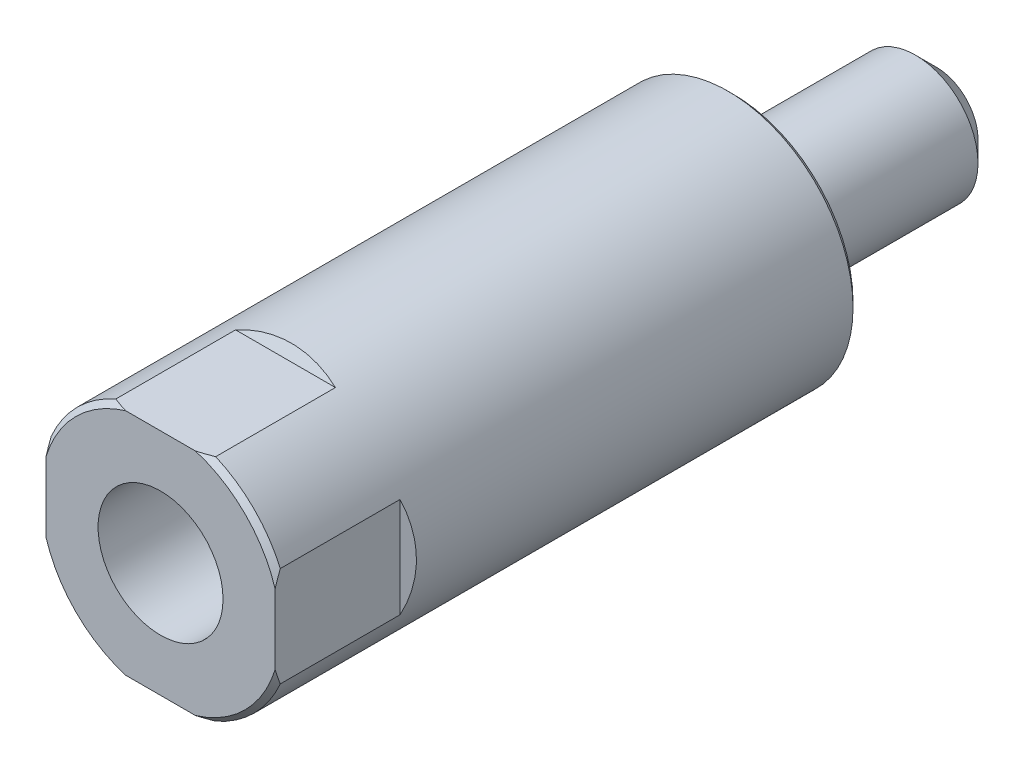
ISO-10303-21;
HEADER;
FILE_DESCRIPTION(('STEP AP214'),'2;1');
FILE_NAME('part.step','',(''),(''),'','','');
FILE_SCHEMA(('AUTOMOTIVE_DESIGN { 1 0 10303 214 1 1 1 1 }'));
ENDSEC;
DATA;
#1=APPLICATION_CONTEXT('core data for automotive mechanical design processes');
#2=APPLICATION_PROTOCOL_DEFINITION('international standard','automotive_design',2000,#1);
#3=PRODUCT_CONTEXT('',#1,'mechanical');
#4=PRODUCT('Part','Part','',(#3));
#5=PRODUCT_RELATED_PRODUCT_CATEGORY('part','',(#4));
#6=PRODUCT_DEFINITION_FORMATION('','',#4);
#7=PRODUCT_DEFINITION_CONTEXT('part definition',#1,'design');
#8=PRODUCT_DEFINITION('design','',#6,#7);
#9=PRODUCT_DEFINITION_SHAPE('','',#8);
#10=(LENGTH_UNIT() NAMED_UNIT(*) SI_UNIT(.MILLI.,.METRE.));
#11=(NAMED_UNIT(*) PLANE_ANGLE_UNIT() SI_UNIT($,.RADIAN.));
#12=(NAMED_UNIT(*) SI_UNIT($,.STERADIAN.) SOLID_ANGLE_UNIT());
#13=UNCERTAINTY_MEASURE_WITH_UNIT(LENGTH_MEASURE(1.E-05),#10,'distance_accuracy_value','');
#14=(GEOMETRIC_REPRESENTATION_CONTEXT(3) GLOBAL_UNCERTAINTY_ASSIGNED_CONTEXT((#13)) GLOBAL_UNIT_ASSIGNED_CONTEXT((#10,
#11,#12)) REPRESENTATION_CONTEXT('',''));
#15=CARTESIAN_POINT('',(0.,0.,0.));
#16=DIRECTION('',(0.,0.,1.));
#17=DIRECTION('',(1.,0.,0.));
#18=AXIS2_PLACEMENT_3D('',#15,#16,#17);
#19=CARTESIAN_POINT('',(0.,0.,-19.5));
#20=DIRECTION('',(0.,0.,1.));
#21=DIRECTION('',(1.,0.,0.));
#22=AXIS2_PLACEMENT_3D('',#19,#20,#21);
#23=PLANE('',#22);
#24=CARTESIAN_POINT('',(0.,0.,-19.5));
#25=DIRECTION('',(0.,0.,1.));
#26=DIRECTION('',(1.,0.,0.));
#27=AXIS2_PLACEMENT_3D('',#24,#25,#26);
#28=CIRCLE('',#27,4.);
#29=CARTESIAN_POINT('',(4.,0.,-19.5));
#30=VERTEX_POINT('',#29);
#31=EDGE_CURVE('E139',#30,#30,#28,.F.);
#32=ORIENTED_EDGE('',*,*,#31,.T.);
#33=EDGE_LOOP('',(#32));
#34=FACE_BOUND('',#33,.T.);
#35=ADVANCED_FACE('F14',(#34),#23,.F.);
#36=CARTESIAN_POINT('',(0.,0.,0.5));
#37=DIRECTION('',(0.,0.,1.));
#38=DIRECTION('',(1.,0.,0.));
#39=AXIS2_PLACEMENT_3D('',#36,#37,#38);
#40=CYLINDRICAL_SURFACE('',#39,6.);
#41=CARTESIAN_POINT('',(0.,0.,-17.5));
#42=DIRECTION('',(0.,0.,1.));
#43=DIRECTION('',(1.,0.,0.));
#44=AXIS2_PLACEMENT_3D('',#41,#42,#43);
#45=CIRCLE('',#44,6.);
#46=CARTESIAN_POINT('',(6.,0.,-17.5));
#47=VERTEX_POINT('',#46);
#48=EDGE_CURVE('E175',#47,#47,#45,.T.);
#49=ORIENTED_EDGE('',*,*,#48,.T.);
#50=EDGE_LOOP('',(#49));
#51=FACE_BOUND('',#50,.T.);
#52=CARTESIAN_POINT('',(0.,1.32706345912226E-13,0.));
#53=DIRECTION('',(0.,0.,1.));
#54=DIRECTION('',(1.,0.,0.));
#55=AXIS2_PLACEMENT_3D('',#52,#53,#54);
#56=CIRCLE('',#55,6.);
#57=CARTESIAN_POINT('',(6.,1.32706345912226E-13,0.));
#58=VERTEX_POINT('',#57);
#59=EDGE_CURVE('E136',#58,#58,#56,.T.);
#60=ORIENTED_EDGE('',*,*,#59,.F.);
#61=EDGE_LOOP('',(#60));
#62=FACE_BOUND('',#61,.T.);
#63=ADVANCED_FACE('F426',(#51,#62),#40,.T.);
#64=CARTESIAN_POINT('',(6.,0.,10.5));
#65=DIRECTION('',(0.,0.,-1.));
#66=DIRECTION('',(-1.,0.,0.));
#67=AXIS2_PLACEMENT_3D('',#64,#65,#66);
#68=PLANE('',#67);
#69=CARTESIAN_POINT('',(0.,0.,10.5));
#70=DIRECTION('',(0.,0.,1.));
#71=DIRECTION('',(1.,0.,0.));
#72=AXIS2_PLACEMENT_3D('',#69,#70,#71);
#73=CIRCLE('',#72,6.);
#74=CARTESIAN_POINT('',(6.,0.,10.5));
#75=VERTEX_POINT('',#74);
#76=EDGE_CURVE('E121',#75,#75,#73,.T.);
#77=ORIENTED_EDGE('',*,*,#76,.T.);
#78=EDGE_LOOP('',(#77));
#79=FACE_BOUND('',#78,.T.);
#80=ADVANCED_FACE('F353',(#79),#68,.F.);
#81=CARTESIAN_POINT('',(11.,-12.,43.));
#82=DIRECTION('',(-0.5,0.,-0.866025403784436));
#83=DIRECTION('',(-0.866025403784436,0.,0.5));
#84=AXIS2_PLACEMENT_3D('',#81,#82,#83);
#85=PLANE('',#84);
#86=CARTESIAN_POINT('',(0.,0.,49.350852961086));
#87=DIRECTION('',(-0.5,0.,-0.866025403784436));
#88=DIRECTION('',(0.866025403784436,0.,-0.5));
#89=AXIS2_PLACEMENT_3D('',#86,#87,#88);
#90=ELLIPSE('',#89,13.8564064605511,12.);
#91=CARTESIAN_POINT('',(11.,4.7958315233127,43.));
#92=VERTEX_POINT('',#91);
#93=CARTESIAN_POINT('',(11.,-4.79583152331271,43.));
#94=VERTEX_POINT('',#93);
#95=EDGE_CURVE('E158',#92,#94,#90,.T.);
#96=ORIENTED_EDGE('',*,*,#95,.F.);
#97=DIRECTION('',(0.,1.,0.));
#98=VECTOR('',#97,1.);
#99=CARTESIAN_POINT('',(11.,-12.,43.));
#100=LINE('',#99,#98);
#101=EDGE_CURVE('E149',#94,#92,#100,.T.);
#102=ORIENTED_EDGE('',*,*,#101,.F.);
#103=EDGE_LOOP('',(#96,#102));
#104=FACE_BOUND('',#103,.T.);
#105=ADVANCED_FACE('F223',(#104),#85,.F.);
#106=CARTESIAN_POINT('',(11.,-12.,55.));
#107=DIRECTION('',(-1.,0.,0.));
#108=DIRECTION('',(0.,0.,1.));
#109=AXIS2_PLACEMENT_3D('',#106,#107,#108);
#110=PLANE('',#109);
#111=DIRECTION('',(0.,-1.,0.));
#112=VECTOR('',#111,1.);
#113=CARTESIAN_POINT('',(11.,0.,55.));
#114=LINE('',#113,#112);
#115=CARTESIAN_POINT('',(11.,3.35410196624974,55.));
#116=VERTEX_POINT('',#115);
#117=CARTESIAN_POINT('',(11.,-3.35410196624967,55.));
#118=VERTEX_POINT('',#117);
#119=EDGE_CURVE('E156',#116,#118,#114,.T.);
#120=ORIENTED_EDGE('',*,*,#119,.T.);
#121=CARTESIAN_POINT('',(11.,-3.35410196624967,55.));
#122=CARTESIAN_POINT('',(11.,-3.47626806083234,54.9643692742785));
#123=CARTESIAN_POINT('',(11.,-3.59795060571,54.9270977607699));
#124=CARTESIAN_POINT('',(11.,-3.84025690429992,54.8494888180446));
#125=CARTESIAN_POINT('',(11.,-3.96088123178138,54.8091531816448));
#126=CARTESIAN_POINT('',(11.,-4.20111636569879,54.7255915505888));
#127=CARTESIAN_POINT('',(11.,-4.32072721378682,54.6823656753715));
#128=CARTESIAN_POINT('',(11.,-4.55900582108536,54.5931815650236));
#129=CARTESIAN_POINT('',(11.,-4.67767299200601,54.5472217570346));
#130=CARTESIAN_POINT('',(11.,-4.79583152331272,54.5));
#131=B_SPLINE_CURVE_WITH_KNOTS('',3,(#121,#122,#123,#124,#125,#126,#127,#128,#129,#130),
.UNSPECIFIED.,.F.,.F.,(4,2,2,2,4),(0.,0.381749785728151,0.763277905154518,1.14479026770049,
1.5265242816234),.UNSPECIFIED.);
#132=CARTESIAN_POINT('',(11.,-4.79583152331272,54.5));
#133=VERTEX_POINT('',#132);
#134=EDGE_CURVE('E22',#118,#133,#131,.T.);
#135=ORIENTED_EDGE('',*,*,#134,.T.);
#136=DIRECTION('',(0.,0.,-1.));
#137=VECTOR('',#136,1.);
#138=CARTESIAN_POINT('',(11.,-4.79583152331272,55.));
#139=LINE('',#138,#137);
#140=EDGE_CURVE('E152',#94,#133,#139,.F.);
#141=ORIENTED_EDGE('',*,*,#140,.F.);
#142=ORIENTED_EDGE('',*,*,#101,.T.);
#143=DIRECTION('',(0.,0.,-1.));
#144=VECTOR('',#143,1.);
#145=CARTESIAN_POINT('',(11.,4.79583152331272,55.));
#146=LINE('',#145,#144);
#147=CARTESIAN_POINT('',(11.,4.79583152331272,54.5));
#148=VERTEX_POINT('',#147);
#149=EDGE_CURVE('E154',#148,#92,#146,.T.);
#150=ORIENTED_EDGE('',*,*,#149,.F.);
#151=CARTESIAN_POINT('',(11.,4.79583152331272,54.5));
#152=CARTESIAN_POINT('',(11.,4.67767299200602,54.5472217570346));
#153=CARTESIAN_POINT('',(11.,4.55900582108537,54.5931815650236));
#154=CARTESIAN_POINT('',(11.,4.32072721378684,54.6823656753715));
#155=CARTESIAN_POINT('',(11.,4.20111636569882,54.7255915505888));
#156=CARTESIAN_POINT('',(11.,3.96088123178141,54.8091531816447));
#157=CARTESIAN_POINT('',(11.,3.84025690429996,54.8494888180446));
#158=CARTESIAN_POINT('',(11.,3.59795060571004,54.9270977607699));
#159=CARTESIAN_POINT('',(11.,3.47626806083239,54.9643692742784));
#160=CARTESIAN_POINT('',(11.,3.35410196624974,55.));
#161=B_SPLINE_CURVE_WITH_KNOTS('',3,(#151,#152,#153,#154,#155,#156,#157,#158,#159,#160),
.UNSPECIFIED.,.F.,.F.,(4,2,2,2,4),(0.,0.381734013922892,0.763246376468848,1.1447744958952,
1.52652428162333),.UNSPECIFIED.);
#162=EDGE_CURVE('E227',#148,#116,#161,.T.);
#163=ORIENTED_EDGE('',*,*,#162,.T.);
#164=EDGE_LOOP('',(#120,#135,#141,#142,#150,#163));
#165=FACE_BOUND('',#164,.T.);
#166=ADVANCED_FACE('F217',(#165),#110,.F.);
#167=CARTESIAN_POINT('',(12.,11.,43.));
#168=DIRECTION('',(0.,-0.5,-0.866025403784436));
#169=DIRECTION('',(0.,0.866025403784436,-0.5));
#170=AXIS2_PLACEMENT_3D('',#167,#168,#169);
#171=PLANE('',#170);
#172=CARTESIAN_POINT('',(0.,0.,49.350852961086));
#173=DIRECTION('',(0.,-0.5,-0.866025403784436));
#174=DIRECTION('',(0.,0.866025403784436,-0.5));
#175=AXIS2_PLACEMENT_3D('',#172,#173,#174);
#176=ELLIPSE('',#175,13.8564064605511,12.);
#177=CARTESIAN_POINT('',(-4.79583152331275,11.,43.));
#178=VERTEX_POINT('',#177);
#179=CARTESIAN_POINT('',(4.79583152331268,11.,43.));
#180=VERTEX_POINT('',#179);
#181=EDGE_CURVE('E168',#178,#180,#176,.T.);
#182=ORIENTED_EDGE('',*,*,#181,.F.);
#183=DIRECTION('',(-1.,0.,0.));
#184=VECTOR('',#183,1.);
#185=CARTESIAN_POINT('',(12.,11.,43.));
#186=LINE('',#185,#184);
#187=EDGE_CURVE('E114',#180,#178,#186,.T.);
#188=ORIENTED_EDGE('',*,*,#187,.F.);
#189=EDGE_LOOP('',(#182,#188));
#190=FACE_BOUND('',#189,.T.);
#191=ADVANCED_FACE('F222',(#190),#171,.F.);
#192=CARTESIAN_POINT('',(12.,11.,55.));
#193=DIRECTION('',(0.,-1.,0.));
#194=DIRECTION('',(1.,0.,0.));
#195=AXIS2_PLACEMENT_3D('',#192,#193,#194);
#196=PLANE('',#195);
#197=DIRECTION('',(0.,0.,-1.));
#198=VECTOR('',#197,1.);
#199=CARTESIAN_POINT('',(-4.79583152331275,11.,55.));
#200=LINE('',#199,#198);
#201=CARTESIAN_POINT('',(-4.79583152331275,11.,54.5));
#202=VERTEX_POINT('',#201);
#203=EDGE_CURVE('E133',#202,#178,#200,.T.);
#204=ORIENTED_EDGE('',*,*,#203,.F.);
#205=CARTESIAN_POINT('',(-4.79583152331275,11.,54.5));
#206=CARTESIAN_POINT('',(-4.67767299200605,11.,54.5472217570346));
#207=CARTESIAN_POINT('',(-4.55900582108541,10.9999999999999,54.5931815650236));
#208=CARTESIAN_POINT('',(-4.32072721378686,10.9999999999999,54.6823656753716));
#209=CARTESIAN_POINT('',(-4.20111636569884,10.9999999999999,54.7255915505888));
#210=CARTESIAN_POINT('',(-3.96088123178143,10.9999999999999,54.8091531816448));
#211=CARTESIAN_POINT('',(-3.84025690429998,10.9999999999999,54.8494888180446));
#212=CARTESIAN_POINT('',(-3.59795060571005,10.9999999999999,54.92709776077));
#213=CARTESIAN_POINT('',(-3.47626806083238,11.,54.9643692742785));
#214=CARTESIAN_POINT('',(-3.35410196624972,11.,55.));
#215=B_SPLINE_CURVE_WITH_KNOTS('',3,(#205,#206,#207,#208,#209,#210,#211,#212,#213,#214),
.UNSPECIFIED.,.F.,.F.,(4,2,2,2,4),(0.,0.381734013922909,0.763246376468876,1.14477449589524,
1.52652428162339),.UNSPECIFIED.);
#216=CARTESIAN_POINT('',(-3.3541019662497,11.,55.));
#217=VERTEX_POINT('',#216);
#218=EDGE_CURVE('E253',#202,#217,#215,.T.);
#219=ORIENTED_EDGE('',*,*,#218,.T.);
#220=DIRECTION('',(1.,0.,0.));
#221=VECTOR('',#220,1.);
#222=CARTESIAN_POINT('',(0.,11.,55.));
#223=LINE('',#222,#221);
#224=CARTESIAN_POINT('',(3.3541019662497,11.,55.));
#225=VERTEX_POINT('',#224);
#226=EDGE_CURVE('E165',#217,#225,#223,.T.);
#227=ORIENTED_EDGE('',*,*,#226,.T.);
#228=CARTESIAN_POINT('',(3.3541019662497,11.,55.));
#229=CARTESIAN_POINT('',(3.47626806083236,11.,54.9643692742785));
#230=CARTESIAN_POINT('',(3.59795060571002,11.,54.92709776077));
#231=CARTESIAN_POINT('',(3.84025690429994,11.,54.8494888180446));
#232=CARTESIAN_POINT('',(3.96088123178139,11.,54.8091531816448));
#233=CARTESIAN_POINT('',(4.2011163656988,11.,54.7255915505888));
#234=CARTESIAN_POINT('',(4.32072721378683,11.,54.6823656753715));
#235=CARTESIAN_POINT('',(4.55900582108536,11.,54.5931815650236));
#236=CARTESIAN_POINT('',(4.677672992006,11.,54.5472217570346));
#237=CARTESIAN_POINT('',(4.7958315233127,11.,54.5));
#238=B_SPLINE_CURVE_WITH_KNOTS('',3,(#228,#229,#230,#231,#232,#233,#234,#235,#236,#237),
.UNSPECIFIED.,.F.,.F.,(4,2,2,2,4),(0.,0.381749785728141,0.763277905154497,1.14479026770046,
1.52652428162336),.UNSPECIFIED.);
#239=CARTESIAN_POINT('',(4.79583152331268,11.,54.5));
#240=VERTEX_POINT('',#239);
#241=EDGE_CURVE('E274',#225,#240,#238,.T.);
#242=ORIENTED_EDGE('',*,*,#241,.T.);
#243=DIRECTION('',(0.,0.,-1.));
#244=VECTOR('',#243,1.);
#245=CARTESIAN_POINT('',(4.79583152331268,11.,55.));
#246=LINE('',#245,#244);
#247=EDGE_CURVE('E131',#180,#240,#246,.F.);
#248=ORIENTED_EDGE('',*,*,#247,.F.);
#249=ORIENTED_EDGE('',*,*,#187,.T.);
#250=EDGE_LOOP('',(#204,#219,#227,#242,#248,#249));
#251=FACE_BOUND('',#250,.T.);
#252=ADVANCED_FACE('F267',(#251),#196,.F.);
#253=CARTESIAN_POINT('',(-11.,-12.,43.));
#254=DIRECTION('',(0.5,0.,-0.866025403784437));
#255=DIRECTION('',(-0.866025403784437,0.,-0.5));
#256=AXIS2_PLACEMENT_3D('',#253,#254,#255);
#257=PLANE('',#256);
#258=CARTESIAN_POINT('',(0.,0.,49.3508529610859));
#259=DIRECTION('',(0.5,0.,-0.866025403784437));
#260=DIRECTION('',(-0.866025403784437,0.,-0.5));
#261=AXIS2_PLACEMENT_3D('',#258,#259,#260);
#262=ELLIPSE('',#261,13.856406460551,12.);
#263=CARTESIAN_POINT('',(-11.,-4.79583152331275,43.));
#264=VERTEX_POINT('',#263);
#265=CARTESIAN_POINT('',(-11.,4.79583152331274,43.));
#266=VERTEX_POINT('',#265);
#267=EDGE_CURVE('E163',#264,#266,#262,.T.);
#268=ORIENTED_EDGE('',*,*,#267,.F.);
#269=DIRECTION('',(0.,1.,0.));
#270=VECTOR('',#269,1.);
#271=CARTESIAN_POINT('',(-11.,-12.,43.));
#272=LINE('',#271,#270);
#273=EDGE_CURVE('E142',#264,#266,#272,.T.);
#274=ORIENTED_EDGE('',*,*,#273,.T.);
#275=EDGE_LOOP('',(#268,#274));
#276=FACE_BOUND('',#275,.T.);
#277=ADVANCED_FACE('F213',(#276),#257,.F.);
#278=CARTESIAN_POINT('',(-11.,-12.,55.));
#279=DIRECTION('',(1.,0.,0.));
#280=DIRECTION('',(0.,0.,-1.));
#281=AXIS2_PLACEMENT_3D('',#278,#279,#280);
#282=PLANE('',#281);
#283=DIRECTION('',(0.,1.,0.));
#284=VECTOR('',#283,1.);
#285=CARTESIAN_POINT('',(-11.,0.,55.));
#286=LINE('',#285,#284);
#287=CARTESIAN_POINT('',(-11.,-3.35410196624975,55.));
#288=VERTEX_POINT('',#287);
#289=CARTESIAN_POINT('',(-11.,3.35410196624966,55.));
#290=VERTEX_POINT('',#289);
#291=EDGE_CURVE('E160',#288,#290,#286,.T.);
#292=ORIENTED_EDGE('',*,*,#291,.T.);
#293=CARTESIAN_POINT('',(-11.,3.35410196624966,55.));
#294=CARTESIAN_POINT('',(-11.,3.47626806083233,54.9643692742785));
#295=CARTESIAN_POINT('',(-11.,3.59795060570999,54.9270977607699));
#296=CARTESIAN_POINT('',(-11.,3.84025690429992,54.8494888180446));
#297=CARTESIAN_POINT('',(-11.,3.96088123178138,54.8091531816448));
#298=CARTESIAN_POINT('',(-11.,4.2011163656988,54.7255915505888));
#299=CARTESIAN_POINT('',(-11.,4.32072721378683,54.6823656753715));
#300=CARTESIAN_POINT('',(-11.,4.55900582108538,54.5931815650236));
#301=CARTESIAN_POINT('',(-11.,4.67767299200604,54.5472217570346));
#302=CARTESIAN_POINT('',(-11.,4.79583152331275,54.5));
#303=B_SPLINE_CURVE_WITH_KNOTS('',3,(#293,#294,#295,#296,#297,#298,#299,#300,#301,#302),
.UNSPECIFIED.,.F.,.F.,(4,2,2,2,4),(0.,0.381749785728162,0.763277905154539,1.14479026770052,
1.52652428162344),.UNSPECIFIED.);
#304=CARTESIAN_POINT('',(-11.,4.79583152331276,54.5));
#305=VERTEX_POINT('',#304);
#306=EDGE_CURVE('E198',#290,#305,#303,.T.);
#307=ORIENTED_EDGE('',*,*,#306,.T.);
#308=DIRECTION('',(0.,0.,-1.));
#309=VECTOR('',#308,1.);
#310=CARTESIAN_POINT('',(-11.,4.79583152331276,55.));
#311=LINE('',#310,#309);
#312=EDGE_CURVE('E145',#266,#305,#311,.F.);
#313=ORIENTED_EDGE('',*,*,#312,.F.);
#314=ORIENTED_EDGE('',*,*,#273,.F.);
#315=DIRECTION('',(0.,0.,-1.));
#316=VECTOR('',#315,1.);
#317=CARTESIAN_POINT('',(-11.,-4.79583152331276,55.));
#318=LINE('',#317,#316);
#319=CARTESIAN_POINT('',(-11.,-4.79583152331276,54.5));
#320=VERTEX_POINT('',#319);
#321=EDGE_CURVE('E147',#320,#264,#318,.T.);
#322=ORIENTED_EDGE('',*,*,#321,.F.);
#323=CARTESIAN_POINT('',(-11.,-4.79583152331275,54.5));
#324=CARTESIAN_POINT('',(-11.,-4.67767299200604,54.5472217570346));
#325=CARTESIAN_POINT('',(-11.,-4.5590058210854,54.5931815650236));
#326=CARTESIAN_POINT('',(-11.,-4.32072721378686,54.6823656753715));
#327=CARTESIAN_POINT('',(-11.,-4.20111636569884,54.7255915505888));
#328=CARTESIAN_POINT('',(-11.,-3.96088123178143,54.8091531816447));
#329=CARTESIAN_POINT('',(-11.,-3.84025690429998,54.8494888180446));
#330=CARTESIAN_POINT('',(-11.,-3.59795060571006,54.9270977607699));
#331=CARTESIAN_POINT('',(-11.,-3.4762680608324,54.9643692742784));
#332=CARTESIAN_POINT('',(-11.,-3.35410196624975,55.));
#333=B_SPLINE_CURVE_WITH_KNOTS('',3,(#323,#324,#325,#326,#327,#328,#329,#330,#331,#332),
.UNSPECIFIED.,.F.,.F.,(4,2,2,2,4),(0.,0.381734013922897,0.763246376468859,1.14477449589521,
1.52652428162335),.UNSPECIFIED.);
#334=EDGE_CURVE('E190',#320,#288,#333,.T.);
#335=ORIENTED_EDGE('',*,*,#334,.T.);
#336=EDGE_LOOP('',(#292,#307,#313,#314,#322,#335));
#337=FACE_BOUND('',#336,.T.);
#338=ADVANCED_FACE('F208',(#337),#282,.F.);
#339=CARTESIAN_POINT('',(12.,-11.,43.));
#340=DIRECTION('',(0.,0.5,-0.866025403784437));
#341=DIRECTION('',(0.,0.866025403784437,0.5));
#342=AXIS2_PLACEMENT_3D('',#339,#340,#341);
#343=PLANE('',#342);
#344=CARTESIAN_POINT('',(0.,0.,49.3508529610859));
#345=DIRECTION('',(0.,0.5,-0.866025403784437));
#346=DIRECTION('',(0.,-0.866025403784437,-0.5));
#347=AXIS2_PLACEMENT_3D('',#344,#345,#346);
#348=ELLIPSE('',#347,13.856406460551,12.);
#349=CARTESIAN_POINT('',(4.79583152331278,-11.,43.));
#350=VERTEX_POINT('',#349);
#351=CARTESIAN_POINT('',(-4.79583152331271,-11.,43.));
#352=VERTEX_POINT('',#351);
#353=EDGE_CURVE('E107',#350,#352,#348,.T.);
#354=ORIENTED_EDGE('',*,*,#353,.F.);
#355=DIRECTION('',(-1.,0.,0.));
#356=VECTOR('',#355,1.);
#357=CARTESIAN_POINT('',(12.,-11.,43.));
#358=LINE('',#357,#356);
#359=EDGE_CURVE('E120',#350,#352,#358,.T.);
#360=ORIENTED_EDGE('',*,*,#359,.T.);
#361=EDGE_LOOP('',(#354,#360));
#362=FACE_BOUND('',#361,.T.);
#363=ADVANCED_FACE('F119',(#362),#343,.F.);
#364=CARTESIAN_POINT('',(12.,-11.,55.));
#365=DIRECTION('',(0.,1.,0.));
#366=DIRECTION('',(-1.,0.,0.));
#367=AXIS2_PLACEMENT_3D('',#364,#365,#366);
#368=PLANE('',#367);
#369=DIRECTION('',(-1.,0.,0.));
#370=VECTOR('',#369,1.);
#371=CARTESIAN_POINT('',(0.,-11.,55.));
#372=LINE('',#371,#370);
#373=CARTESIAN_POINT('',(3.35410196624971,-11.,55.));
#374=VERTEX_POINT('',#373);
#375=CARTESIAN_POINT('',(-3.35410196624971,-11.,55.));
#376=VERTEX_POINT('',#375);
#377=EDGE_CURVE('E122',#374,#376,#372,.T.);
#378=ORIENTED_EDGE('',*,*,#377,.T.);
#379=CARTESIAN_POINT('',(-3.35410196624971,-11.,55.));
#380=CARTESIAN_POINT('',(-3.47626806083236,-11.,54.9643692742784));
#381=CARTESIAN_POINT('',(-3.59795060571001,-11.,54.9270977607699));
#382=CARTESIAN_POINT('',(-3.84025690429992,-11.0000000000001,54.8494888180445));
#383=CARTESIAN_POINT('',(-3.96088123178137,-11.0000000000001,54.8091531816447));
#384=CARTESIAN_POINT('',(-4.20111636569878,-11.0000000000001,54.7255915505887));
#385=CARTESIAN_POINT('',(-4.3207272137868,-11.0000000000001,54.6823656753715));
#386=CARTESIAN_POINT('',(-4.55900582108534,-11.0000000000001,54.5931815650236));
#387=CARTESIAN_POINT('',(-4.67767299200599,-11.,54.5472217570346));
#388=CARTESIAN_POINT('',(-4.7958315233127,-11.,54.5));
#389=B_SPLINE_CURVE_WITH_KNOTS('',3,(#379,#380,#381,#382,#383,#384,#385,#386,#387,#388),
.UNSPECIFIED.,.F.,.F.,(4,2,2,2,4),(0.,0.381749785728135,0.76327790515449,1.14479026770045,
1.52652428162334),.UNSPECIFIED.);
#390=CARTESIAN_POINT('',(-4.79583152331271,-11.,54.5));
#391=VERTEX_POINT('',#390);
#392=EDGE_CURVE('E252',#376,#391,#389,.T.);
#393=ORIENTED_EDGE('',*,*,#392,.T.);
#394=DIRECTION('',(0.,0.,-1.));
#395=VECTOR('',#394,1.);
#396=CARTESIAN_POINT('',(-4.79583152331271,-11.,55.));
#397=LINE('',#396,#395);
#398=EDGE_CURVE('E115',#352,#391,#397,.F.);
#399=ORIENTED_EDGE('',*,*,#398,.F.);
#400=ORIENTED_EDGE('',*,*,#359,.F.);
#401=DIRECTION('',(0.,0.,-1.));
#402=VECTOR('',#401,1.);
#403=CARTESIAN_POINT('',(4.79583152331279,-11.,55.));
#404=LINE('',#403,#402);
#405=CARTESIAN_POINT('',(4.79583152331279,-11.,54.5));
#406=VERTEX_POINT('',#405);
#407=EDGE_CURVE('E102',#406,#350,#404,.T.);
#408=ORIENTED_EDGE('',*,*,#407,.F.);
#409=CARTESIAN_POINT('',(4.79583152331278,-11.,54.5));
#410=CARTESIAN_POINT('',(4.67767299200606,-11.,54.5472217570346));
#411=CARTESIAN_POINT('',(4.5590058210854,-11.,54.5931815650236));
#412=CARTESIAN_POINT('',(4.32072721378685,-11.,54.6823656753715));
#413=CARTESIAN_POINT('',(4.20111636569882,-11.,54.7255915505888));
#414=CARTESIAN_POINT('',(3.9608812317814,-11.,54.8091531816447));
#415=CARTESIAN_POINT('',(3.84025690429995,-11.,54.8494888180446));
#416=CARTESIAN_POINT('',(3.59795060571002,-11.,54.9270977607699));
#417=CARTESIAN_POINT('',(3.47626806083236,-11.,54.9643692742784));
#418=CARTESIAN_POINT('',(3.3541019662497,-11.,55.));
#419=B_SPLINE_CURVE_WITH_KNOTS('',3,(#409,#410,#411,#412,#413,#414,#415,#416,#417,#418),
.UNSPECIFIED.,.F.,.F.,(4,2,2,2,4),(0.,0.381734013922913,0.763246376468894,1.14477449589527,
1.52652428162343),.UNSPECIFIED.);
#420=EDGE_CURVE('E245',#406,#374,#419,.T.);
#421=ORIENTED_EDGE('',*,*,#420,.T.);
#422=EDGE_LOOP('',(#378,#393,#399,#400,#408,#421));
#423=FACE_BOUND('',#422,.T.);
#424=ADVANCED_FACE('F125',(#423),#368,.F.);
#425=CARTESIAN_POINT('',(0.,0.,55.));
#426=DIRECTION('',(0.,0.,-1.));
#427=DIRECTION('',(-1.,0.,0.));
#428=AXIS2_PLACEMENT_3D('',#425,#426,#427);
#429=CYLINDRICAL_SURFACE('',#428,12.);
#430=CARTESIAN_POINT('',(0.,0.,0.5));
#431=DIRECTION('',(0.,0.,1.));
#432=DIRECTION('',(1.,0.,0.));
#433=AXIS2_PLACEMENT_3D('',#430,#431,#432);
#434=CIRCLE('',#433,12.);
#435=CARTESIAN_POINT('',(12.,0.,0.5));
#436=VERTEX_POINT('',#435);
#437=EDGE_CURVE('E285',#436,#436,#434,.T.);
#438=ORIENTED_EDGE('',*,*,#437,.T.);
#439=EDGE_LOOP('',(#438));
#440=FACE_BOUND('',#439,.T.);
#441=ORIENTED_EDGE('',*,*,#312,.T.);
#442=CARTESIAN_POINT('',(0.,0.,54.5));
#443=DIRECTION('',(0.,0.,1.));
#444=DIRECTION('',(1.,0.,0.));
#445=AXIS2_PLACEMENT_3D('',#442,#443,#444);
#446=CIRCLE('',#445,12.);
#447=EDGE_CURVE('E280',#305,#202,#446,.F.);
#448=ORIENTED_EDGE('',*,*,#447,.T.);
#449=ORIENTED_EDGE('',*,*,#203,.T.);
#450=ORIENTED_EDGE('',*,*,#181,.T.);
#451=ORIENTED_EDGE('',*,*,#247,.T.);
#452=CARTESIAN_POINT('',(0.,0.,54.5));
#453=DIRECTION('',(0.,0.,1.));
#454=DIRECTION('',(1.,0.,0.));
#455=AXIS2_PLACEMENT_3D('',#452,#453,#454);
#456=CIRCLE('',#455,12.);
#457=EDGE_CURVE('E36',#240,#148,#456,.F.);
#458=ORIENTED_EDGE('',*,*,#457,.T.);
#459=ORIENTED_EDGE('',*,*,#149,.T.);
#460=ORIENTED_EDGE('',*,*,#95,.T.);
#461=ORIENTED_EDGE('',*,*,#140,.T.);
#462=CARTESIAN_POINT('',(0.,0.,54.5));
#463=DIRECTION('',(0.,0.,1.));
#464=DIRECTION('',(1.,0.,0.));
#465=AXIS2_PLACEMENT_3D('',#462,#463,#464);
#466=CIRCLE('',#465,12.);
#467=EDGE_CURVE('E110',#133,#406,#466,.F.);
#468=ORIENTED_EDGE('',*,*,#467,.T.);
#469=ORIENTED_EDGE('',*,*,#407,.T.);
#470=ORIENTED_EDGE('',*,*,#353,.T.);
#471=ORIENTED_EDGE('',*,*,#398,.T.);
#472=CARTESIAN_POINT('',(0.,0.,54.5));
#473=DIRECTION('',(0.,0.,1.));
#474=DIRECTION('',(1.,0.,0.));
#475=AXIS2_PLACEMENT_3D('',#472,#473,#474);
#476=CIRCLE('',#475,12.);
#477=EDGE_CURVE('E282',#391,#320,#476,.F.);
#478=ORIENTED_EDGE('',*,*,#477,.T.);
#479=ORIENTED_EDGE('',*,*,#321,.T.);
#480=ORIENTED_EDGE('',*,*,#267,.T.);
#481=EDGE_LOOP('',(#441,#448,#449,#450,#451,#458,#459,#460,#461,#468,#469,#470,#471,#478,#479,#480));
#482=FACE_BOUND('',#481,.T.);
#483=ADVANCED_FACE('F105',(#440,#482),#429,.T.);
#484=CARTESIAN_POINT('',(0.,0.,0.));
#485=DIRECTION('',(0.,0.,1.));
#486=DIRECTION('',(1.,0.,0.));
#487=AXIS2_PLACEMENT_3D('',#484,#485,#486);
#488=PLANE('',#487);
#489=CARTESIAN_POINT('',(0.,0.,0.));
#490=DIRECTION('',(0.,0.,1.));
#491=DIRECTION('',(1.,0.,0.));
#492=AXIS2_PLACEMENT_3D('',#489,#490,#491);
#493=CIRCLE('',#492,11.5);
#494=CARTESIAN_POINT('',(11.5,0.,0.));
#495=VERTEX_POINT('',#494);
#496=EDGE_CURVE('E9',#495,#495,#493,.F.);
#497=ORIENTED_EDGE('',*,*,#496,.T.);
#498=EDGE_LOOP('',(#497));
#499=FACE_BOUND('',#498,.T.);
#500=ORIENTED_EDGE('',*,*,#59,.T.);
#501=EDGE_LOOP('',(#500));
#502=FACE_BOUND('',#501,.T.);
#503=ADVANCED_FACE('F320',(#499,#502),#488,.F.);
#504=CARTESIAN_POINT('',(0.,0.,55.));
#505=DIRECTION('',(0.,0.,1.));
#506=DIRECTION('',(1.,0.,0.));
#507=AXIS2_PLACEMENT_3D('',#504,#505,#506);
#508=PLANE('',#507);
#509=ORIENTED_EDGE('',*,*,#226,.F.);
#510=CARTESIAN_POINT('',(0.,0.,55.));
#511=DIRECTION('',(0.,0.,1.));
#512=DIRECTION('',(1.,0.,0.));
#513=AXIS2_PLACEMENT_3D('',#510,#511,#512);
#514=CIRCLE('',#513,11.5);
#515=EDGE_CURVE('E187',#217,#290,#514,.T.);
#516=ORIENTED_EDGE('',*,*,#515,.T.);
#517=ORIENTED_EDGE('',*,*,#291,.F.);
#518=CARTESIAN_POINT('',(0.,0.,55.));
#519=DIRECTION('',(0.,0.,1.));
#520=DIRECTION('',(1.,0.,0.));
#521=AXIS2_PLACEMENT_3D('',#518,#519,#520);
#522=CIRCLE('',#521,11.5);
#523=EDGE_CURVE('E184',#288,#376,#522,.T.);
#524=ORIENTED_EDGE('',*,*,#523,.T.);
#525=ORIENTED_EDGE('',*,*,#377,.F.);
#526=CARTESIAN_POINT('',(0.,0.,55.));
#527=DIRECTION('',(0.,0.,1.));
#528=DIRECTION('',(1.,0.,0.));
#529=AXIS2_PLACEMENT_3D('',#526,#527,#528);
#530=CIRCLE('',#529,11.5);
#531=EDGE_CURVE('E181',#374,#118,#530,.T.);
#532=ORIENTED_EDGE('',*,*,#531,.T.);
#533=ORIENTED_EDGE('',*,*,#119,.F.);
#534=CARTESIAN_POINT('',(0.,0.,55.));
#535=DIRECTION('',(0.,0.,1.));
#536=DIRECTION('',(1.,0.,0.));
#537=AXIS2_PLACEMENT_3D('',#534,#535,#536);
#538=CIRCLE('',#537,11.5);
#539=EDGE_CURVE('E178',#116,#225,#538,.T.);
#540=ORIENTED_EDGE('',*,*,#539,.T.);
#541=EDGE_LOOP('',(#509,#516,#517,#524,#525,#532,#533,#540));
#542=FACE_BOUND('',#541,.T.);
#543=CARTESIAN_POINT('',(0.,1.32706345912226E-13,55.));
#544=DIRECTION('',(0.,0.,1.));
#545=DIRECTION('',(1.,0.,0.));
#546=AXIS2_PLACEMENT_3D('',#543,#544,#545);
#547=CIRCLE('',#546,6.);
#548=CARTESIAN_POINT('',(6.,1.32706345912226E-13,55.));
#549=VERTEX_POINT('',#548);
#550=EDGE_CURVE('E135',#549,#549,#547,.T.);
#551=ORIENTED_EDGE('',*,*,#550,.F.);
#552=EDGE_LOOP('',(#551));
#553=FACE_BOUND('',#552,.T.);
#554=ADVANCED_FACE('F301',(#542,#553),#508,.T.);
#555=CARTESIAN_POINT('',(0.,1.32706345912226E-13,55.));
#556=DIRECTION('',(0.,0.,1.));
#557=DIRECTION('',(1.,0.,0.));
#558=AXIS2_PLACEMENT_3D('',#555,#556,#557);
#559=CYLINDRICAL_SURFACE('',#558,6.);
#560=ORIENTED_EDGE('',*,*,#76,.F.);
#561=EDGE_LOOP('',(#560));
#562=FACE_BOUND('',#561,.T.);
#563=ORIENTED_EDGE('',*,*,#550,.T.);
#564=EDGE_LOOP('',(#563));
#565=FACE_BOUND('',#564,.T.);
#566=ADVANCED_FACE('F215',(#562,#565),#559,.F.);
#567=CARTESIAN_POINT('',(0.,0.,-19.5));
#568=DIRECTION('',(0.,0.,1.));
#569=DIRECTION('',(1.,0.,0.));
#570=AXIS2_PLACEMENT_3D('',#567,#568,#569);
#571=CONICAL_SURFACE('',#570,4.,0.785398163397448);
#572=ORIENTED_EDGE('',*,*,#48,.F.);
#573=EDGE_LOOP('',(#572));
#574=FACE_BOUND('',#573,.T.);
#575=ORIENTED_EDGE('',*,*,#31,.F.);
#576=EDGE_LOOP('',(#575));
#577=FACE_BOUND('',#576,.T.);
#578=ADVANCED_FACE('F317',(#574,#577),#571,.T.);
#579=CARTESIAN_POINT('',(0.,0.,55.));
#580=DIRECTION('',(0.,0.,-1.));
#581=DIRECTION('',(-1.,0.,0.));
#582=AXIS2_PLACEMENT_3D('',#579,#580,#581);
#583=CONICAL_SURFACE('',#582,11.5,0.785398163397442);
#584=ORIENTED_EDGE('',*,*,#218,.F.);
#585=ORIENTED_EDGE('',*,*,#447,.F.);
#586=ORIENTED_EDGE('',*,*,#306,.F.);
#587=ORIENTED_EDGE('',*,*,#515,.F.);
#588=EDGE_LOOP('',(#584,#585,#586,#587));
#589=FACE_BOUND('',#588,.T.);
#590=ADVANCED_FACE('F298',(#589),#583,.T.);
#591=CARTESIAN_POINT('',(0.,0.,55.));
#592=DIRECTION('',(0.,0.,-1.));
#593=DIRECTION('',(-1.,0.,0.));
#594=AXIS2_PLACEMENT_3D('',#591,#592,#593);
#595=CONICAL_SURFACE('',#594,11.5,0.785398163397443);
#596=ORIENTED_EDGE('',*,*,#334,.F.);
#597=ORIENTED_EDGE('',*,*,#477,.F.);
#598=ORIENTED_EDGE('',*,*,#392,.F.);
#599=ORIENTED_EDGE('',*,*,#523,.F.);
#600=EDGE_LOOP('',(#596,#597,#598,#599));
#601=FACE_BOUND('',#600,.T.);
#602=ADVANCED_FACE('F205',(#601),#595,.T.);
#603=CARTESIAN_POINT('',(0.,0.,55.));
#604=DIRECTION('',(0.,0.,-1.));
#605=DIRECTION('',(-1.,0.,0.));
#606=AXIS2_PLACEMENT_3D('',#603,#604,#605);
#607=CONICAL_SURFACE('',#606,11.5,0.785398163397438);
#608=ORIENTED_EDGE('',*,*,#420,.F.);
#609=ORIENTED_EDGE('',*,*,#467,.F.);
#610=ORIENTED_EDGE('',*,*,#134,.F.);
#611=ORIENTED_EDGE('',*,*,#531,.F.);
#612=EDGE_LOOP('',(#608,#609,#610,#611));
#613=FACE_BOUND('',#612,.T.);
#614=ADVANCED_FACE('F237',(#613),#607,.T.);
#615=CARTESIAN_POINT('',(0.,0.,55.));
#616=DIRECTION('',(0.,0.,-1.));
#617=DIRECTION('',(-1.,0.,0.));
#618=AXIS2_PLACEMENT_3D('',#615,#616,#617);
#619=CONICAL_SURFACE('',#618,11.5,0.785398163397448);
#620=ORIENTED_EDGE('',*,*,#162,.F.);
#621=ORIENTED_EDGE('',*,*,#457,.F.);
#622=ORIENTED_EDGE('',*,*,#241,.F.);
#623=ORIENTED_EDGE('',*,*,#539,.F.);
#624=EDGE_LOOP('',(#620,#621,#622,#623));
#625=FACE_BOUND('',#624,.T.);
#626=ADVANCED_FACE('F240',(#625),#619,.T.);
#627=CARTESIAN_POINT('',(0.,0.,0.5));
#628=DIRECTION('',(0.,0.,1.));
#629=DIRECTION('',(1.,0.,0.));
#630=AXIS2_PLACEMENT_3D('',#627,#628,#629);
#631=CONICAL_SURFACE('',#630,12.,0.785398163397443);
#632=ORIENTED_EDGE('',*,*,#496,.F.);
#633=EDGE_LOOP('',(#632));
#634=FACE_BOUND('',#633,.T.);
#635=ORIENTED_EDGE('',*,*,#437,.F.);
#636=EDGE_LOOP('',(#635));
#637=FACE_BOUND('',#636,.T.);
#638=ADVANCED_FACE('F16',(#634,#637),#631,.T.);
#639=CLOSED_SHELL('',(#35,#63,#80,#105,#166,#191,#252,#277,#338,#363,#424,#483,#503,#554,#566,
#578,#590,#602,#614,#626,#638));
#640=MANIFOLD_SOLID_BREP('B1',#639);
#641=ADVANCED_BREP_SHAPE_REPRESENTATION('',(#18,#640),#14);
#642=SHAPE_DEFINITION_REPRESENTATION(#9,#641);
ENDSEC;
END-ISO-10303-21;
